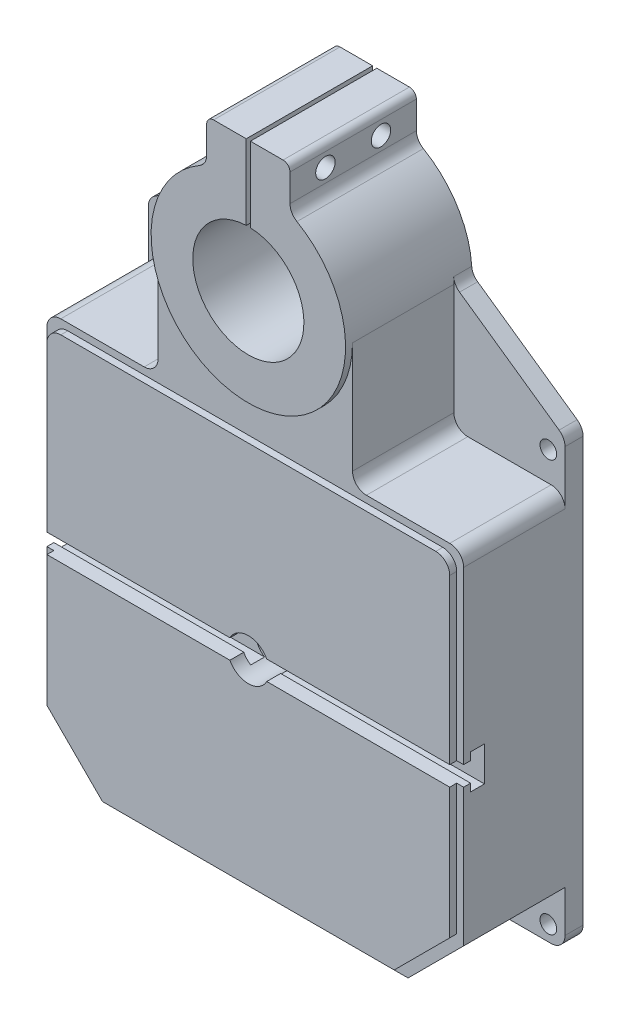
from build123d import *

# Parameters (mm, degrees)
SKETCH_1_R           = 15
SKETCH_1_R_2         = 40
SKETCH_1_R_3         = 6
EXTRUDE_1_DEPTH      = 13
SKETCH_2_R           = 15
SKETCH_2_R_2         = 40
EXTRUDE_2_DEPTH      = 73
SKETCH_3_R           = 15
SKETCH_3_R_2         = 40
EXTRUDE_3_DEPTH      = 5
CUT_EXTRUDE_1_DEPTH  = 66
EXTRUDE_START        = 15
SKETCH_5_W           = 274
SKETCH_5_H           = 45
SKETCH_5_R           = 15
EXTRUDE_4_DEPTH      = 15
FILLET_1_R           = 5
CUT_EXTRUDE_2_DEPTH  = 300
SKETCH_7_W           = 3
SKETCH_7_H           = 92
CUT_EXTRUDE_3_DEPTH  = 60
SKETCH_8_R           = 7
CUT_EXTRUDE_4_DEPTH  = 10
CUT_EXTRUDE_5_REACH  = 379.037
SKETCH_9_R           = 4.5
SKETCH_10_R          = 11
CUT_EXTRUDE_6_DEPTH  = 13
SKETCH_11_R          = 10
SKETCH_11_R_2        = 2.5
CUT_EXTRUDE_8_DEPTH  = 15
CUT_EXTRUDE_10_DEPTH = 66


with BuildPart() as part:
    # Sketch 1 → Extrude 1 (new body)
    with BuildSketch(Plane.XY):
        with BuildLine():
            Line((150, 168.794329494), (150, -136))
            ThreePointArc((150, -136), (147.071067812, -143.071067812), (140, -146))
            Line((140, -146), (-140, -146))
            ThreePointArc((-140, -146), (-147.071067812, -143.071067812), (-150, -136))
            Line((-150, -136), (-150, 168.794329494))
            ThreePointArc((-150, 168.794329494), (-148.870108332, 173.411815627), (-145.735764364, 176.985849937))
            Line((-145.735764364, 176.985849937), (-74.085308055, 227.156039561))
            ThreePointArc((-74.085308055, 227.156039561), (-71.110338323, 230.436031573), (-69.843438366, 234.679115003))
            ThreePointArc((-69.843438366, 234.679115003), (-59.417438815, 267.007674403), (-35, 290.621778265))
            ThreePointArc((-35, 290.621778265), (-31.339745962, 294.282032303), (-30, 299.282032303))
            Line((-30, 299.282032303), (-30, 319))
            ThreePointArc((-30, 319), (-28.535533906, 322.535533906), (-25, 324))
            Line((-25, 324), (0, 324))
            Line((0, 324), (25, 324))
            ThreePointArc((25, 324), (28.535533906, 322.535533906), (30, 319))
            Line((30, 319), (30, 299.282032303))
            ThreePointArc((30, 299.282032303), (31.339745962, 294.282032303), (35, 290.621778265))
            ThreePointArc((35, 290.621778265), (59.417438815, 267.007674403), (69.843438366, 234.679115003))
            ThreePointArc((69.843438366, 234.679115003), (71.110338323, 230.436031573), (74.085308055, 227.156039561))
            Line((74.085308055, 227.156039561), (145.735764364, 176.985849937))
            ThreePointArc((145.735764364, 176.985849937), (148.870108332, 173.411815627), (150, 168.794329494))
        make_face()
        with Locations(Location((0, 0, 0), (0, 0, 180))):
            Circle(SKETCH_1_R, mode=Mode.SUBTRACT)
        with Locations(Location((0, 230, 0), (0, 0, 180))):
            Circle(SKETCH_1_R_2, mode=Mode.SUBTRACT)
        with Locations(Location((-138, -135, 0), (0, 0, 180))):
            Circle(SKETCH_1_R_3, mode=Mode.SUBTRACT)
        with Locations(Location((-138, 161, 0), (0, 0, 180))):
            Circle(SKETCH_1_R_3, mode=Mode.SUBTRACT)
        with Locations(Location((138, -135, 0), (0, 0, 180))):
            Circle(SKETCH_1_R_3, mode=Mode.SUBTRACT)
        with Locations(Location((138, 161, 0), (0, 0, 180))):
            Circle(SKETCH_1_R_3, mode=Mode.SUBTRACT)
    extrude(amount=EXTRUDE_1_DEPTH)

    # Sketch 2 → Extrude 2 (add)
    with BuildSketch(Plane.XY.offset(13)):
        with BuildLine():
            Line((-110, -146), (110, -146))
            Line((110, -146), (150, -106))
            Line((150, -106), (150, 130))
            ThreePointArc((150, 130), (147.071067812, 137.071067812), (140, 140))
            Line((140, 140), (80, 140))
            ThreePointArc((80, 140), (72.928932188, 142.928932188), (70, 150))
            Line((70, 150), (70, 230))
            ThreePointArc((70, 230), (60.621778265, 265), (35, 290.621778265))
            ThreePointArc((35, 290.621778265), (31.339745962, 294.282032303), (30, 299.282032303))
            Line((30, 299.282032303), (30, 319))
            ThreePointArc((30, 319), (28.535533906, 322.535533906), (25, 324))
            Line((25, 324), (-25, 324))
            ThreePointArc((-25, 324), (-28.535533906, 322.535533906), (-30, 319))
            Line((-30, 319), (-30, 299.282032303))
            ThreePointArc((-30, 299.282032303), (-31.339745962, 294.282032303), (-35, 290.621778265))
            ThreePointArc((-35, 290.621778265), (-60.621778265, 265), (-70, 230))
            Line((-70, 230), (-70, 150))
            ThreePointArc((-70, 150), (-72.928932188, 142.928932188), (-80, 140))
            Line((-80, 140), (-140, 140))
            ThreePointArc((-140, 140), (-147.071067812, 137.071067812), (-150, 130))
            Line((-150, 130), (-150, -106))
            Line((-150, -106), (-110, -146))
        make_face()
        with Locations(Location((0, 0, 0), (0, 0, 180))):
            Circle(SKETCH_2_R, mode=Mode.SUBTRACT)
        with Locations(Location((0, 230, 0), (0, 0, 180))):
            Circle(SKETCH_2_R_2, mode=Mode.SUBTRACT)
    extrude(amount=EXTRUDE_2_DEPTH)

    # Sketch 3 → Extrude 3 (add)
    # profile 1 of 2: a face of its own
    with BuildSketch(Plane.XY.offset(86)):
        with BuildLine():
            Line((145, 125), (145, -101))
            Line((145, -101), (105, -141))
            Line((105, -141), (-105, -141))
            Line((-105, -141), (-145, -101))
            Line((-145, -101), (-145, 125))
            ThreePointArc((-145, 125), (-142.071067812, 132.071067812), (-135, 135))
            Line((-135, 135), (135, 135))
            ThreePointArc((135, 135), (142.071067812, 132.071067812), (145, 125))
        make_face()
        with Locations(Location((0, 0, 0), (0, 0, 180))):
            Circle(SKETCH_3_R, mode=Mode.SUBTRACT)
    # profile 2 of 2: a face of its own
    with BuildSketch(Plane.XY.offset(86)):
        with BuildLine():
            Line((30, 299.282032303), (30, 319))
            ThreePointArc((30, 319), (28.535533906, 322.535533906), (25, 324))
            Line((25, 324), (-25, 324))
            ThreePointArc((-25, 324), (-28.535533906, 322.535533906), (-30, 319))
            Line((-30, 319), (-30, 299.282032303))
            ThreePointArc((-30, 299.282032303), (-31.339745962, 294.282032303), (-35, 290.621778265))
            ThreePointArc((-35, 290.621778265), (0, 160), (35, 290.621778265))
            ThreePointArc((35, 290.621778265), (31.339745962, 294.282032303), (30, 299.282032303))
        make_face()
        with Locations(Location((0, 230, 0), (0, 0, 180))):
            Circle(SKETCH_3_R_2, mode=Mode.SUBTRACT)
    extrude(amount=EXTRUDE_3_DEPTH)

    # Sketch 4 → Cut-Extrude 1 (cut)
    with BuildSketch(Plane(origin=(0, 0, 0), x_dir=(-1, 0, 0), z_dir=(0, 0, -1))):
        with BuildLine():
            Line((137, 127), (137, -83))
            Line((137, -83), (97, -123))
            Line((97, -123), (-97, -123))
            Line((-97, -123), (-137, -83))
            Line((-137, -83), (-137, 127))
            ThreePointArc((-137, 127), (-134.071067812, 134.071067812), (-127, 137))
            Line((-127, 137), (-69, 137))
            ThreePointArc((-69, 137), (-61.928932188, 139.928932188), (-59, 147))
            Line((-59, 147), (-59, 172))
            ThreePointArc((-59, 172), (-56.071067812, 179.071067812), (-49, 182))
            Line((-49, 182), (0, 182))
            Line((0, 182), (49, 182))
            ThreePointArc((49, 182), (56.071067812, 179.071067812), (59, 172))
            Line((59, 172), (59, 147))
            ThreePointArc((59, 147), (61.928932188, 139.928932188), (69, 137))
            Line((69, 137), (127, 137))
            ThreePointArc((127, 137), (134.071067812, 134.071067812), (137, 127))
        make_face()
    extrude(amount=-CUT_EXTRUDE_1_DEPTH, mode=Mode.SUBTRACT)

    # Sketch 5 → Extrude 4 (add)
    with BuildSketch(Plane(origin=(0, 0, 66), x_dir=(-1, 0, 0), z_dir=(0, 0, -1)).offset(EXTRUDE_START)):
        Rectangle(SKETCH_5_W, SKETCH_5_H)
        Circle(SKETCH_5_R, mode=Mode.SUBTRACT)
    extrude(amount=-EXTRUDE_4_DEPTH)

    # Fillet 1
    fillet_1_edges = [part.edges().sort_by_distance(p)[0] for p in [
        (137, 22.5, 58.5),
        (137, -22.5, 58.5),
        (-137, -22.5, 58.5),
        (-137, 22.5, 58.5),
    ]]
    fillet(fillet_1_edges, radius=FILLET_1_R)

    # Sketch 6 → Cut-Extrude 2 (cut)
    with BuildSketch(Plane.ZY.offset(150)):
        Polygon((71, 12.5), (71, -12.5), (81, -12.5), (81, -7), (92, -7), (92, 7), (81, 7), (81, 12.5), align=None)
    extrude(amount=-CUT_EXTRUDE_2_DEPTH, mode=Mode.SUBTRACT)

    # Sketch 7 → Cut-Extrude 3 (cut)
    with BuildSketch(Plane(origin=(0, 324, 0), x_dir=(1, 0, 0), z_dir=(0, 1, 0))):
        with Locations((0, -45.5)):
            Rectangle(SKETCH_7_W, SKETCH_7_H)
    extrude(amount=-CUT_EXTRUDE_3_DEPTH, mode=Mode.SUBTRACT)

    # Sketch 8 → Cut-Extrude 4 (cut)
    with BuildSketch(Plane(origin=(30, 0, 0), x_dir=(0, 0, -1), z_dir=(1, 0, 0))):
        with Locations(Location((-65.5, 309, 0), (0, 0, 90))):
            Circle(SKETCH_8_R)
        with Locations(Location((-25.5, 309, 0), (0, 0, 90))):
            Circle(SKETCH_8_R)
    extrude(amount=-CUT_EXTRUDE_4_DEPTH, mode=Mode.SUBTRACT)

    # Cut-Extrude 5: up to this face of the body (flat: up to its plane)
    cut_extrude_5_end = Plane(part.part.faces().sort_by_distance((-30, 309.141016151, 43))[0])
    # Sketch 9 → Cut-Extrude 5 (cut, up to the picked face)
    with BuildSketch(Plane(origin=(20, 0, 0), x_dir=(0, 0, -1), z_dir=(1, 0, 0)), mode=Mode.PRIVATE) as cut_extrude_5_sk1:
        with Locations(Location((-65.5, 309, 0), (0, 0, 90))):
            Circle(SKETCH_9_R)
    cut_extrude_5_tool1 = split(extrude(cut_extrude_5_sk1.sketch, amount=-CUT_EXTRUDE_5_REACH, mode=Mode.PRIVATE), bisect_by=cut_extrude_5_end, keep=Keep.BOTH, mode=Mode.PRIVATE)
    # Sketch 9 → Cut-Extrude 5 (cut, up to the picked face)
    with BuildSketch(Plane(origin=(20, 0, 0), x_dir=(0, 0, -1), z_dir=(1, 0, 0)), mode=Mode.PRIVATE) as cut_extrude_5_sk2:
        with Locations(Location((-25.5, 309, 0), (0, 0, 90))):
            Circle(SKETCH_9_R)
    cut_extrude_5_tool2 = split(extrude(cut_extrude_5_sk2.sketch, amount=-CUT_EXTRUDE_5_REACH, mode=Mode.PRIVATE), bisect_by=cut_extrude_5_end, keep=Keep.BOTH, mode=Mode.PRIVATE)
    add(cut_extrude_5_tool1.solids().sort_by(Axis((20, 309, 65.5), (-1, 0, 0)))[0], mode=Mode.SUBTRACT)
    add(cut_extrude_5_tool2.solids().sort_by(Axis((20, 309, 25.5), (-1, 0, 0)))[0], mode=Mode.SUBTRACT)

    # Sketch 10 → Cut-Extrude 6 (cut)
    with BuildSketch(Plane.ZY.offset(150)):
        with Locations((35, 100)):
            Circle(SKETCH_10_R)
    extrude(amount=-CUT_EXTRUDE_6_DEPTH, mode=Mode.SUBTRACT)

    # Sketch 11 → Cut-Extrude 8 (cut)
    with BuildSketch(Plane.XZ.offset(146)):
        with Locations((32, 49.5)):
            Circle(SKETCH_11_R)
        with Locations((47, 49.5)):
            Circle(SKETCH_11_R_2)
        with Locations((-47, 49.5)):
            Circle(SKETCH_11_R_2)
    extrude(amount=-CUT_EXTRUDE_8_DEPTH, mode=Mode.SUBTRACT)

    # Sketch 12 → Cut-Extrude 10 (cut)
    with BuildSketch(Plane(origin=(0, 0, 0), x_dir=(-1, 0, 0), z_dir=(0, 0, -1))):
        Polygon((-97, -133), (97, -133), (137, -93), (137, -83), (97, -123), (-97, -123), (-137, -83), (-137, -93), align=None)
    extrude(amount=-CUT_EXTRUDE_10_DEPTH, mode=Mode.SUBTRACT)


solid = part.part
